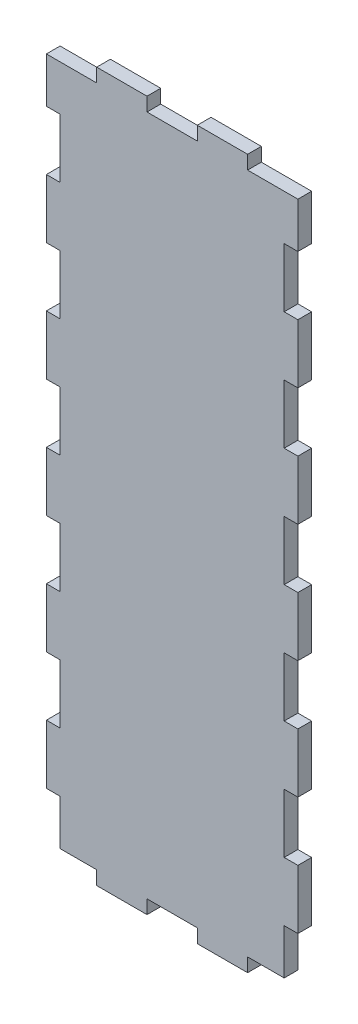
from build123d import *

# Parameters (mm, degrees)
SKETCH1_W           = 55
SKETCH1_H           = 155
BOSS_EXTRUDE1_DEPTH = 3
SKETCH2_W           = 3
SKETCH2_H           = 12.916666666
SKETCH2_H_2         = 12.916666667
CUT_EXTRUDE1_DEPTH  = 3
SKETCH3_W           = 11
SKETCH3_H           = 3
SKETCH3_W_2         = 8
CUT_EXTRUDE2_DEPTH  = 3


with BuildPart() as part:
    # Sketch1 → Boss-Extrude1 (new body)
    with BuildSketch(Plane.XY):
        Rectangle(SKETCH1_W, SKETCH1_H)
    extrude(amount=BOSS_EXTRUDE1_DEPTH)

    # Sketch2 → Cut-Extrude1 (cut)
    with BuildSketch(Plane.XY.offset(3)):
        with Locations((-26, 58.125)):
            Rectangle(SKETCH2_W, SKETCH2_H)
        with Locations((-26, 32.291666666)):
            Rectangle(SKETCH2_W, SKETCH2_H_2)
        with Locations((-26, 6.458333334)):
            Rectangle(SKETCH2_W, SKETCH2_H_2)
        with Locations((-26, -19.375)):
            Rectangle(SKETCH2_W, SKETCH2_H)
        with Locations((-26, -45.208333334)):
            Rectangle(SKETCH2_W, SKETCH2_H_2)
        with Locations((-26, -71.041666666)):
            Rectangle(SKETCH2_W, SKETCH2_H_2)
        with Locations((26, -71.041666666)):
            Rectangle(SKETCH2_W, SKETCH2_H_2)
        with Locations((26, -45.208333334)):
            Rectangle(SKETCH2_W, SKETCH2_H_2)
        with Locations((26, -19.375)):
            Rectangle(SKETCH2_W, SKETCH2_H)
        with Locations((26, 6.458333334)):
            Rectangle(SKETCH2_W, SKETCH2_H_2)
        with Locations((26, 32.291666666)):
            Rectangle(SKETCH2_W, SKETCH2_H_2)
        with Locations((26, 58.125)):
            Rectangle(SKETCH2_W, SKETCH2_H)
    extrude(amount=-CUT_EXTRUDE1_DEPTH, mode=Mode.SUBTRACT)

    # Sketch3 → Cut-Extrude2 (cut)
    with BuildSketch(Plane.XY.offset(3)):
        with Locations((-22, 76)):
            Rectangle(SKETCH3_W, SKETCH3_H)
        with Locations((22, 76)):
            Rectangle(SKETCH3_W, SKETCH3_H)
        with Locations((0, 76)):
            Rectangle(SKETCH3_W, SKETCH3_H)
        with Locations((20.5, -76)):
            Rectangle(SKETCH3_W_2, SKETCH3_H)
        with Locations((0, -76)):
            Rectangle(SKETCH3_W, SKETCH3_H)
        with Locations((-20.5, -76)):
            Rectangle(SKETCH3_W_2, SKETCH3_H)
    extrude(amount=-CUT_EXTRUDE2_DEPTH, mode=Mode.SUBTRACT)


solid = part.part
